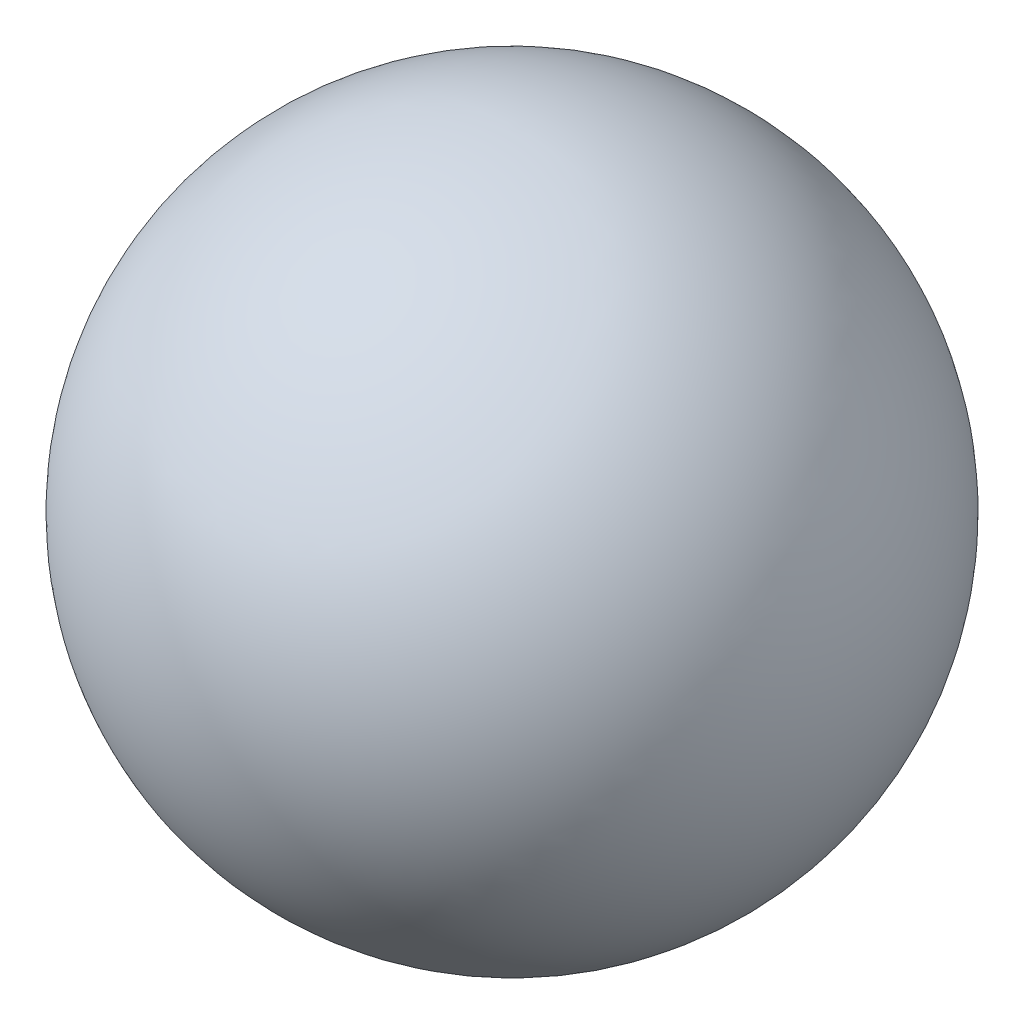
ISO-10303-21;
HEADER;
FILE_DESCRIPTION(('STEP AP214'),'2;1');
FILE_NAME('part.step','',(''),(''),'','','');
FILE_SCHEMA(('AUTOMOTIVE_DESIGN { 1 0 10303 214 1 1 1 1 }'));
ENDSEC;
DATA;
#1=APPLICATION_CONTEXT('core data for automotive mechanical design processes');
#2=APPLICATION_PROTOCOL_DEFINITION('international standard','automotive_design',2000,#1);
#3=PRODUCT_CONTEXT('',#1,'mechanical');
#4=PRODUCT('Part','Part','',(#3));
#5=PRODUCT_RELATED_PRODUCT_CATEGORY('part','',(#4));
#6=PRODUCT_DEFINITION_FORMATION('','',#4);
#7=PRODUCT_DEFINITION_CONTEXT('part definition',#1,'design');
#8=PRODUCT_DEFINITION('design','',#6,#7);
#9=PRODUCT_DEFINITION_SHAPE('','',#8);
#10=(LENGTH_UNIT() NAMED_UNIT(*) SI_UNIT(.MILLI.,.METRE.));
#11=(NAMED_UNIT(*) PLANE_ANGLE_UNIT() SI_UNIT($,.RADIAN.));
#12=(NAMED_UNIT(*) SI_UNIT($,.STERADIAN.) SOLID_ANGLE_UNIT());
#13=UNCERTAINTY_MEASURE_WITH_UNIT(LENGTH_MEASURE(1.E-05),#10,'distance_accuracy_value','');
#14=(GEOMETRIC_REPRESENTATION_CONTEXT(3) GLOBAL_UNCERTAINTY_ASSIGNED_CONTEXT((#13)) GLOBAL_UNIT_ASSIGNED_CONTEXT((#10,
#11,#12)) REPRESENTATION_CONTEXT('',''));
#15=CARTESIAN_POINT('',(0.,0.,0.));
#16=DIRECTION('',(0.,0.,1.));
#17=DIRECTION('',(1.,0.,0.));
#18=AXIS2_PLACEMENT_3D('',#15,#16,#17);
#19=CARTESIAN_POINT('',(0.,0.,13.));
#20=DIRECTION('',(0.,0.,1.));
#21=DIRECTION('',(0.,1.,0.));
#22=AXIS2_PLACEMENT_3D('',#19,#20,#21);
#23=SPHERICAL_SURFACE('',#22,16.);
#24=CARTESIAN_POINT('',(0.,0.,0.));
#25=DIRECTION('',(0.,0.,1.));
#26=DIRECTION('',(1.,0.,0.));
#27=AXIS2_PLACEMENT_3D('',#24,#25,#26);
#28=CIRCLE('',#27,9.32737905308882);
#29=CARTESIAN_POINT('',(9.32737905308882,0.,0.));
#30=VERTEX_POINT('',#29);
#31=EDGE_CURVE('E23',#30,#30,#28,.T.);
#32=ORIENTED_EDGE('',*,*,#31,.T.);
#33=EDGE_LOOP('',(#32));
#34=FACE_BOUND('',#33,.T.);
#35=ADVANCED_FACE('F12',(#34),#23,.T.);
#36=CARTESIAN_POINT('',(0.,0.,0.));
#37=DIRECTION('',(0.,0.,1.));
#38=DIRECTION('',(1.,0.,0.));
#39=AXIS2_PLACEMENT_3D('',#36,#37,#38);
#40=PLANE('',#39);
#41=CARTESIAN_POINT('',(0.,0.,0.));
#42=DIRECTION('',(0.,0.,1.));
#43=DIRECTION('',(1.,0.,0.));
#44=AXIS2_PLACEMENT_3D('',#41,#42,#43);
#45=CIRCLE('',#44,5.65);
#46=CARTESIAN_POINT('',(5.65,0.,0.));
#47=VERTEX_POINT('',#46);
#48=EDGE_CURVE('E8',#47,#47,#45,.T.);
#49=ORIENTED_EDGE('',*,*,#48,.T.);
#50=EDGE_LOOP('',(#49));
#51=FACE_BOUND('',#50,.T.);
#52=ORIENTED_EDGE('',*,*,#31,.F.);
#53=EDGE_LOOP('',(#52));
#54=FACE_BOUND('',#53,.T.);
#55=ADVANCED_FACE('F37',(#51,#54),#40,.F.);
#56=CARTESIAN_POINT('',(0.,0.,20.));
#57=DIRECTION('',(0.,0.,-1.));
#58=DIRECTION('',(-1.,0.,0.));
#59=AXIS2_PLACEMENT_3D('',#56,#57,#58);
#60=CYLINDRICAL_SURFACE('',#59,5.);
#61=CARTESIAN_POINT('',(0.,0.,0.649999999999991));
#62=DIRECTION('',(0.,0.,1.));
#63=DIRECTION('',(1.,0.,0.));
#64=AXIS2_PLACEMENT_3D('',#61,#62,#63);
#65=CIRCLE('',#64,5.);
#66=CARTESIAN_POINT('',(5.,0.,0.649999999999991));
#67=VERTEX_POINT('',#66);
#68=EDGE_CURVE('E19',#67,#67,#65,.F.);
#69=ORIENTED_EDGE('',*,*,#68,.T.);
#70=EDGE_LOOP('',(#69));
#71=FACE_BOUND('',#70,.T.);
#72=CARTESIAN_POINT('',(0.,0.,20.));
#73=DIRECTION('',(0.,0.,-1.));
#74=DIRECTION('',(-1.,0.,0.));
#75=AXIS2_PLACEMENT_3D('',#72,#73,#74);
#76=CIRCLE('',#75,5.);
#77=CARTESIAN_POINT('',(-5.,0.,20.));
#78=VERTEX_POINT('',#77);
#79=EDGE_CURVE('E27',#78,#78,#76,.T.);
#80=ORIENTED_EDGE('',*,*,#79,.F.);
#81=EDGE_LOOP('',(#80));
#82=FACE_BOUND('',#81,.T.);
#83=ADVANCED_FACE('F35',(#71,#82),#60,.F.);
#84=CARTESIAN_POINT('',(0.,0.,20.));
#85=DIRECTION('',(0.,0.,-1.));
#86=DIRECTION('',(-1.,0.,0.));
#87=AXIS2_PLACEMENT_3D('',#84,#85,#86);
#88=PLANE('',#87);
#89=ORIENTED_EDGE('',*,*,#79,.T.);
#90=EDGE_LOOP('',(#89));
#91=FACE_BOUND('',#90,.T.);
#92=ADVANCED_FACE('F33',(#91),#88,.T.);
#93=CARTESIAN_POINT('',(0.,0.,0.649999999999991));
#94=DIRECTION('',(0.,0.,-1.));
#95=DIRECTION('',(-1.,0.,0.));
#96=AXIS2_PLACEMENT_3D('',#93,#94,#95);
#97=CONICAL_SURFACE('',#96,5.,0.78539816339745);
#98=ORIENTED_EDGE('',*,*,#48,.F.);
#99=EDGE_LOOP('',(#98));
#100=FACE_BOUND('',#99,.T.);
#101=ORIENTED_EDGE('',*,*,#68,.F.);
#102=EDGE_LOOP('',(#101));
#103=FACE_BOUND('',#102,.T.);
#104=ADVANCED_FACE('F14',(#100,#103),#97,.F.);
#105=CLOSED_SHELL('',(#35,#55,#83,#92,#104));
#106=MANIFOLD_SOLID_BREP('B1',#105);
#107=ADVANCED_BREP_SHAPE_REPRESENTATION('',(#18,#106),#14);
#108=SHAPE_DEFINITION_REPRESENTATION(#9,#107);
ENDSEC;
END-ISO-10303-21;
